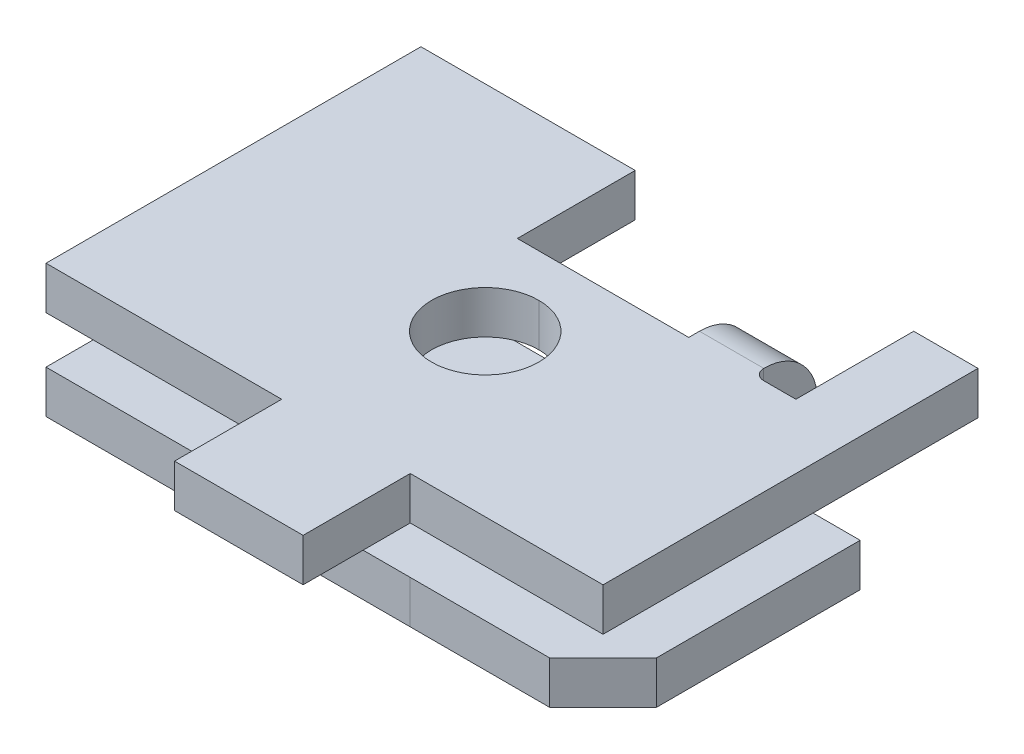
ISO-10303-21;
HEADER;
FILE_DESCRIPTION(('STEP AP214'),'2;1');
FILE_NAME('part.step','',(''),(''),'','','');
FILE_SCHEMA(('AUTOMOTIVE_DESIGN { 1 0 10303 214 1 1 1 1 }'));
ENDSEC;
DATA;
#1=APPLICATION_CONTEXT('core data for automotive mechanical design processes');
#2=APPLICATION_PROTOCOL_DEFINITION('international standard','automotive_design',2000,#1);
#3=PRODUCT_CONTEXT('',#1,'mechanical');
#4=PRODUCT('Part','Part','',(#3));
#5=PRODUCT_RELATED_PRODUCT_CATEGORY('part','',(#4));
#6=PRODUCT_DEFINITION_FORMATION('','',#4);
#7=PRODUCT_DEFINITION_CONTEXT('part definition',#1,'design');
#8=PRODUCT_DEFINITION('design','',#6,#7);
#9=PRODUCT_DEFINITION_SHAPE('','',#8);
#10=(LENGTH_UNIT() NAMED_UNIT(*) SI_UNIT(.MILLI.,.METRE.));
#11=(NAMED_UNIT(*) PLANE_ANGLE_UNIT() SI_UNIT($,.RADIAN.));
#12=(NAMED_UNIT(*) SI_UNIT($,.STERADIAN.) SOLID_ANGLE_UNIT());
#13=UNCERTAINTY_MEASURE_WITH_UNIT(LENGTH_MEASURE(1.E-05),#10,'distance_accuracy_value','');
#14=(GEOMETRIC_REPRESENTATION_CONTEXT(3) GLOBAL_UNCERTAINTY_ASSIGNED_CONTEXT((#13)) GLOBAL_UNIT_ASSIGNED_CONTEXT((#10,
#11,#12)) REPRESENTATION_CONTEXT('',''));
#15=CARTESIAN_POINT('',(0.,0.,0.));
#16=DIRECTION('',(0.,0.,1.));
#17=DIRECTION('',(1.,0.,0.));
#18=AXIS2_PLACEMENT_3D('',#15,#16,#17);
#19=CARTESIAN_POINT('',(7.89110178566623,6.01717338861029,12.2699844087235));
#20=DIRECTION('',(-1.,0.,0.));
#21=DIRECTION('',(0.,1.,0.));
#22=AXIS2_PLACEMENT_3D('',#19,#20,#21);
#23=PLANE('',#22);
#24=DIRECTION('',(0.,1.,0.));
#25=VECTOR('',#24,1.);
#26=CARTESIAN_POINT('',(7.89110178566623,5.51717338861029,12.7699844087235));
#27=LINE('',#26,#25);
#28=CARTESIAN_POINT('',(7.89110178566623,3.5171733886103,12.7699844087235));
#29=VERTEX_POINT('',#28);
#30=CARTESIAN_POINT('',(7.89110178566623,5.51717338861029,12.7699844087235));
#31=VERTEX_POINT('',#30);
#32=EDGE_CURVE('E481',#29,#31,#27,.T.);
#33=ORIENTED_EDGE('',*,*,#32,.T.);
#34=DIRECTION('',(0.,0.,-1.));
#35=VECTOR('',#34,1.);
#36=CARTESIAN_POINT('',(7.89110178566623,5.51717338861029,12.2699844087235));
#37=LINE('',#36,#35);
#38=CARTESIAN_POINT('',(7.89110178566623,5.51717338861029,12.2699844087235));
#39=VERTEX_POINT('',#38);
#40=EDGE_CURVE('E377',#31,#39,#37,.T.);
#41=ORIENTED_EDGE('',*,*,#40,.T.);
#42=CARTESIAN_POINT('',(7.89110178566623,6.01717338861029,12.2699844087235));
#43=DIRECTION('',(1.,0.,0.));
#44=DIRECTION('',(0.,1.,0.));
#45=AXIS2_PLACEMENT_3D('',#42,#43,#44);
#46=CIRCLE('',#45,0.5);
#47=CARTESIAN_POINT('',(7.89110178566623,6.01717338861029,11.7699844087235));
#48=VERTEX_POINT('',#47);
#49=EDGE_CURVE('E359',#39,#48,#46,.T.);
#50=ORIENTED_EDGE('',*,*,#49,.T.);
#51=DIRECTION('',(0.,1.,0.));
#52=VECTOR('',#51,1.);
#53=CARTESIAN_POINT('',(7.89110178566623,6.01717338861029,11.7699844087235));
#54=LINE('',#53,#52);
#55=CARTESIAN_POINT('',(7.89110178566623,7.21717338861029,11.7699844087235));
#56=VERTEX_POINT('',#55);
#57=EDGE_CURVE('E487',#48,#56,#54,.T.);
#58=ORIENTED_EDGE('',*,*,#57,.T.);
#59=CARTESIAN_POINT('',(7.89110178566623,7.21717338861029,12.2699844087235));
#60=DIRECTION('',(1.,0.,0.));
#61=DIRECTION('',(0.,1.,0.));
#62=AXIS2_PLACEMENT_3D('',#59,#60,#61);
#63=CIRCLE('',#62,0.5);
#64=CARTESIAN_POINT('',(7.89110178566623,7.71717338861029,12.2699844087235));
#65=VERTEX_POINT('',#64);
#66=EDGE_CURVE('E406',#56,#65,#63,.T.);
#67=ORIENTED_EDGE('',*,*,#66,.T.);
#68=DIRECTION('',(0.,0.,1.));
#69=VECTOR('',#68,1.);
#70=CARTESIAN_POINT('',(7.89110178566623,7.71717338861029,12.2699844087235));
#71=LINE('',#70,#69);
#72=CARTESIAN_POINT('',(7.89110178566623,7.71717338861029,12.7699844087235));
#73=VERTEX_POINT('',#72);
#74=EDGE_CURVE('E1154',#65,#73,#71,.T.);
#75=ORIENTED_EDGE('',*,*,#74,.T.);
#76=DIRECTION('',(0.,1.,0.));
#77=VECTOR('',#76,1.);
#78=CARTESIAN_POINT('',(7.89110178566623,9.71717338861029,12.7699844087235));
#79=LINE('',#78,#77);
#80=CARTESIAN_POINT('',(7.89110178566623,9.71717338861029,12.7699844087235));
#81=VERTEX_POINT('',#80);
#82=EDGE_CURVE('E478',#73,#81,#79,.T.);
#83=ORIENTED_EDGE('',*,*,#82,.T.);
#84=DIRECTION('',(0.,0.,-1.));
#85=VECTOR('',#84,1.);
#86=CARTESIAN_POINT('',(7.89110178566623,9.71717338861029,12.2699844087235));
#87=LINE('',#86,#85);
#88=CARTESIAN_POINT('',(7.89110178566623,9.71717338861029,12.2699844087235));
#89=VERTEX_POINT('',#88);
#90=EDGE_CURVE('E1040',#81,#89,#87,.T.);
#91=ORIENTED_EDGE('',*,*,#90,.T.);
#92=CARTESIAN_POINT('',(7.89110178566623,7.21717338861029,12.2699844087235));
#93=DIRECTION('',(-1.,0.,0.));
#94=DIRECTION('',(0.,1.,0.));
#95=AXIS2_PLACEMENT_3D('',#92,#93,#94);
#96=CIRCLE('',#95,2.5);
#97=CARTESIAN_POINT('',(7.89110178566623,7.21717338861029,9.76998440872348));
#98=VERTEX_POINT('',#97);
#99=EDGE_CURVE('E423',#89,#98,#96,.T.);
#100=ORIENTED_EDGE('',*,*,#99,.T.);
#101=DIRECTION('',(0.,-1.,0.));
#102=VECTOR('',#101,1.);
#103=CARTESIAN_POINT('',(7.89110178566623,6.01717338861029,9.76998440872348));
#104=LINE('',#103,#102);
#105=CARTESIAN_POINT('',(7.89110178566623,6.01717338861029,9.76998440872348));
#106=VERTEX_POINT('',#105);
#107=EDGE_CURVE('E33',#98,#106,#104,.T.);
#108=ORIENTED_EDGE('',*,*,#107,.T.);
#109=CARTESIAN_POINT('',(7.89110178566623,6.01717338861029,12.2699844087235));
#110=DIRECTION('',(-1.,0.,0.));
#111=DIRECTION('',(0.,1.,0.));
#112=AXIS2_PLACEMENT_3D('',#109,#110,#111);
#113=CIRCLE('',#112,2.5);
#114=CARTESIAN_POINT('',(7.89110178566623,3.5171733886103,12.2699844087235));
#115=VERTEX_POINT('',#114);
#116=EDGE_CURVE('E433',#106,#115,#113,.T.);
#117=ORIENTED_EDGE('',*,*,#116,.T.);
#118=DIRECTION('',(0.,0.,1.));
#119=VECTOR('',#118,1.);
#120=CARTESIAN_POINT('',(7.89110178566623,3.5171733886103,12.2699844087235));
#121=LINE('',#120,#119);
#122=EDGE_CURVE('E383',#115,#29,#121,.T.);
#123=ORIENTED_EDGE('',*,*,#122,.T.);
#124=EDGE_LOOP('',(#33,#41,#50,#58,#67,#75,#83,#91,#100,#108,#117,#123));
#125=FACE_BOUND('',#124,.T.);
#126=ADVANCED_FACE('F15',(#125),#23,.T.);
#127=CARTESIAN_POINT('',(-10.1088982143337,9.7171733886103,24.7699844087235));
#128=DIRECTION('',(0.,0.,1.));
#129=DIRECTION('',(0.,-1.,0.));
#130=AXIS2_PLACEMENT_3D('',#127,#128,#129);
#131=PLANE('',#130);
#132=DIRECTION('',(1.,0.,0.));
#133=VECTOR('',#132,1.);
#134=CARTESIAN_POINT('',(17.8911017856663,7.7171733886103,24.7699844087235));
#135=LINE('',#134,#133);
#136=CARTESIAN_POINT('',(-10.1088982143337,7.7171733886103,24.7699844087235));
#137=VERTEX_POINT('',#136);
#138=CARTESIAN_POINT('',(0.891101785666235,7.7171733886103,24.7699844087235));
#139=VERTEX_POINT('',#138);
#140=EDGE_CURVE('E1002',#137,#139,#135,.T.);
#141=ORIENTED_EDGE('',*,*,#140,.T.);
#142=DIRECTION('',(0.,-1.,0.));
#143=VECTOR('',#142,1.);
#144=CARTESIAN_POINT('',(0.891101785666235,9.7171733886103,24.7699844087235));
#145=LINE('',#144,#143);
#146=CARTESIAN_POINT('',(0.891101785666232,9.71717338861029,24.7699844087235));
#147=VERTEX_POINT('',#146);
#148=EDGE_CURVE('E10',#147,#139,#145,.T.);
#149=ORIENTED_EDGE('',*,*,#148,.F.);
#150=DIRECTION('',(-1.,0.,0.));
#151=VECTOR('',#150,1.);
#152=CARTESIAN_POINT('',(-10.1088982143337,9.7171733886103,24.7699844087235));
#153=LINE('',#152,#151);
#154=CARTESIAN_POINT('',(-10.1088982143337,9.7171733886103,24.7699844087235));
#155=VERTEX_POINT('',#154);
#156=EDGE_CURVE('E1080',#147,#155,#153,.T.);
#157=ORIENTED_EDGE('',*,*,#156,.T.);
#158=DIRECTION('',(0.,-1.,0.));
#159=VECTOR('',#158,1.);
#160=CARTESIAN_POINT('',(-10.1088982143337,9.7171733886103,24.7699844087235));
#161=LINE('',#160,#159);
#162=EDGE_CURVE('E407',#155,#137,#161,.T.);
#163=ORIENTED_EDGE('',*,*,#162,.T.);
#164=EDGE_LOOP('',(#141,#149,#157,#163));
#165=FACE_BOUND('',#164,.T.);
#166=ADVANCED_FACE('F836',(#165),#131,.T.);
#167=CARTESIAN_POINT('',(0.891101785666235,9.7171733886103,24.7699844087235));
#168=DIRECTION('',(-1.,0.,0.));
#169=DIRECTION('',(0.,1.,0.));
#170=AXIS2_PLACEMENT_3D('',#167,#168,#169);
#171=PLANE('',#170);
#172=DIRECTION('',(0.,0.,1.));
#173=VECTOR('',#172,1.);
#174=CARTESIAN_POINT('',(0.891101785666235,7.7171733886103,26.2699844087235));
#175=LINE('',#174,#173);
#176=CARTESIAN_POINT('',(0.891101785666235,7.7171733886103,29.7699844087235));
#177=VERTEX_POINT('',#176);
#178=EDGE_CURVE('E991',#139,#177,#175,.T.);
#179=ORIENTED_EDGE('',*,*,#178,.T.);
#180=DIRECTION('',(0.,-1.,0.));
#181=VECTOR('',#180,1.);
#182=CARTESIAN_POINT('',(0.891101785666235,9.71717338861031,29.7699844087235));
#183=LINE('',#182,#181);
#184=CARTESIAN_POINT('',(0.891101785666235,9.71717338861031,29.7699844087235));
#185=VERTEX_POINT('',#184);
#186=EDGE_CURVE('E399',#185,#177,#183,.T.);
#187=ORIENTED_EDGE('',*,*,#186,.F.);
#188=DIRECTION('',(0.,0.,-1.));
#189=VECTOR('',#188,1.);
#190=CARTESIAN_POINT('',(0.891101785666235,9.7171733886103,24.7699844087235));
#191=LINE('',#190,#189);
#192=EDGE_CURVE('E342',#185,#147,#191,.T.);
#193=ORIENTED_EDGE('',*,*,#192,.T.);
#194=ORIENTED_EDGE('',*,*,#148,.T.);
#195=EDGE_LOOP('',(#179,#187,#193,#194));
#196=FACE_BOUND('',#195,.T.);
#197=ADVANCED_FACE('F828',(#196),#171,.T.);
#198=CARTESIAN_POINT('',(6.89110178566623,9.7171733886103,24.7699844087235));
#199=DIRECTION('',(0.,0.,1.));
#200=DIRECTION('',(0.,-1.,0.));
#201=AXIS2_PLACEMENT_3D('',#198,#199,#200);
#202=PLANE('',#201);
#203=DIRECTION('',(1.,0.,0.));
#204=VECTOR('',#203,1.);
#205=CARTESIAN_POINT('',(17.8911017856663,7.7171733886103,24.7699844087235));
#206=LINE('',#205,#204);
#207=CARTESIAN_POINT('',(6.89110178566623,7.7171733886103,24.7699844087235));
#208=VERTEX_POINT('',#207);
#209=CARTESIAN_POINT('',(15.8911017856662,7.7171733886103,24.7699844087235));
#210=VERTEX_POINT('',#209);
#211=EDGE_CURVE('E983',#208,#210,#206,.T.);
#212=ORIENTED_EDGE('',*,*,#211,.T.);
#213=DIRECTION('',(0.,1.,0.));
#214=VECTOR('',#213,1.);
#215=CARTESIAN_POINT('',(15.8911017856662,7.7171733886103,24.7699844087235));
#216=LINE('',#215,#214);
#217=CARTESIAN_POINT('',(15.8911017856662,9.7171733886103,24.7699844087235));
#218=VERTEX_POINT('',#217);
#219=EDGE_CURVE('E326',#210,#218,#216,.T.);
#220=ORIENTED_EDGE('',*,*,#219,.T.);
#221=DIRECTION('',(-1.,0.,0.));
#222=VECTOR('',#221,1.);
#223=CARTESIAN_POINT('',(6.89110178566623,9.7171733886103,24.7699844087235));
#224=LINE('',#223,#222);
#225=CARTESIAN_POINT('',(6.89110178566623,9.7171733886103,24.7699844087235));
#226=VERTEX_POINT('',#225);
#227=EDGE_CURVE('E324',#218,#226,#224,.T.);
#228=ORIENTED_EDGE('',*,*,#227,.T.);
#229=DIRECTION('',(0.,-1.,0.));
#230=VECTOR('',#229,1.);
#231=CARTESIAN_POINT('',(6.89110178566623,9.7171733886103,24.7699844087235));
#232=LINE('',#231,#230);
#233=EDGE_CURVE('E23',#226,#208,#232,.T.);
#234=ORIENTED_EDGE('',*,*,#233,.T.);
#235=EDGE_LOOP('',(#212,#220,#228,#234));
#236=FACE_BOUND('',#235,.T.);
#237=ADVANCED_FACE('F325',(#236),#202,.T.);
#238=CARTESIAN_POINT('',(6.89110178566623,9.7171733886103,29.7699844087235));
#239=DIRECTION('',(1.,0.,0.));
#240=DIRECTION('',(0.,1.,0.));
#241=AXIS2_PLACEMENT_3D('',#238,#239,#240);
#242=PLANE('',#241);
#243=DIRECTION('',(0.,0.,-1.));
#244=VECTOR('',#243,1.);
#245=CARTESIAN_POINT('',(6.89110178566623,7.7171733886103,26.2699844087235));
#246=LINE('',#245,#244);
#247=CARTESIAN_POINT('',(6.89110178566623,7.7171733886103,29.7699844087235));
#248=VERTEX_POINT('',#247);
#249=EDGE_CURVE('E317',#248,#208,#246,.T.);
#250=ORIENTED_EDGE('',*,*,#249,.T.);
#251=ORIENTED_EDGE('',*,*,#233,.F.);
#252=DIRECTION('',(0.,0.,1.));
#253=VECTOR('',#252,1.);
#254=CARTESIAN_POINT('',(6.89110178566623,9.7171733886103,29.7699844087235));
#255=LINE('',#254,#253);
#256=CARTESIAN_POINT('',(6.89110178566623,9.7171733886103,29.7699844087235));
#257=VERTEX_POINT('',#256);
#258=EDGE_CURVE('E314',#226,#257,#255,.T.);
#259=ORIENTED_EDGE('',*,*,#258,.T.);
#260=DIRECTION('',(0.,-1.,0.));
#261=VECTOR('',#260,1.);
#262=CARTESIAN_POINT('',(6.89110178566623,9.7171733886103,29.7699844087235));
#263=LINE('',#262,#261);
#264=EDGE_CURVE('E402',#257,#248,#263,.T.);
#265=ORIENTED_EDGE('',*,*,#264,.T.);
#266=EDGE_LOOP('',(#250,#251,#259,#265));
#267=FACE_BOUND('',#266,.T.);
#268=ADVANCED_FACE('F312',(#267),#242,.T.);
#269=CARTESIAN_POINT('',(17.8911017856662,6.01717338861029,9.76998440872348));
#270=DIRECTION('',(0.,0.,-1.));
#271=DIRECTION('',(1.,0.,0.));
#272=AXIS2_PLACEMENT_3D('',#269,#270,#271);
#273=PLANE('',#272);
#274=DIRECTION('',(-1.,0.,0.));
#275=VECTOR('',#274,1.);
#276=CARTESIAN_POINT('',(17.8911017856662,7.21717338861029,9.76998440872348));
#277=LINE('',#276,#275);
#278=CARTESIAN_POINT('',(10.8911017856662,7.21717338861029,9.76998440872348));
#279=VERTEX_POINT('',#278);
#280=EDGE_CURVE('E427',#279,#98,#277,.T.);
#281=ORIENTED_EDGE('',*,*,#280,.F.);
#282=DIRECTION('',(0.,-1.,0.));
#283=VECTOR('',#282,1.);
#284=CARTESIAN_POINT('',(10.8911017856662,6.01717338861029,9.76998440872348));
#285=LINE('',#284,#283);
#286=CARTESIAN_POINT('',(10.8911017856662,6.01717338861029,9.76998440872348));
#287=VERTEX_POINT('',#286);
#288=EDGE_CURVE('E443',#279,#287,#285,.T.);
#289=ORIENTED_EDGE('',*,*,#288,.T.);
#290=DIRECTION('',(-1.,0.,0.));
#291=VECTOR('',#290,1.);
#292=CARTESIAN_POINT('',(17.8911017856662,6.01717338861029,9.76998440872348));
#293=LINE('',#292,#291);
#294=EDGE_CURVE('E426',#287,#106,#293,.T.);
#295=ORIENTED_EDGE('',*,*,#294,.T.);
#296=ORIENTED_EDGE('',*,*,#107,.F.);
#297=EDGE_LOOP('',(#281,#289,#295,#296));
#298=FACE_BOUND('',#297,.T.);
#299=ADVANCED_FACE('F571',(#298),#273,.T.);
#300=CARTESIAN_POINT('',(17.8911017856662,6.01717338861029,12.2699844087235));
#301=DIRECTION('',(-1.,0.,0.));
#302=DIRECTION('',(0.,0.,1.));
#303=AXIS2_PLACEMENT_3D('',#300,#301,#302);
#304=CYLINDRICAL_SURFACE('',#303,2.5);
#305=ORIENTED_EDGE('',*,*,#294,.F.);
#306=CARTESIAN_POINT('',(10.8911017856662,6.01717338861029,12.2699844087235));
#307=DIRECTION('',(-1.,0.,0.));
#308=DIRECTION('',(0.,0.,1.));
#309=AXIS2_PLACEMENT_3D('',#306,#307,#308);
#310=CIRCLE('',#309,2.5);
#311=CARTESIAN_POINT('',(10.8911017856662,3.51717338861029,12.2699844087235));
#312=VERTEX_POINT('',#311);
#313=EDGE_CURVE('E378',#287,#312,#310,.T.);
#314=ORIENTED_EDGE('',*,*,#313,.T.);
#315=DIRECTION('',(-1.,0.,0.));
#316=VECTOR('',#315,1.);
#317=CARTESIAN_POINT('',(17.8911017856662,3.51717338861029,12.2699844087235));
#318=LINE('',#317,#316);
#319=EDGE_CURVE('E387',#312,#115,#318,.T.);
#320=ORIENTED_EDGE('',*,*,#319,.T.);
#321=ORIENTED_EDGE('',*,*,#116,.F.);
#322=EDGE_LOOP('',(#305,#314,#320,#321));
#323=FACE_BOUND('',#322,.T.);
#324=ADVANCED_FACE('F566',(#323),#304,.T.);
#325=CARTESIAN_POINT('',(17.8911017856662,7.21717338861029,12.2699844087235));
#326=DIRECTION('',(-1.,0.,0.));
#327=DIRECTION('',(0.,0.,1.));
#328=AXIS2_PLACEMENT_3D('',#325,#326,#327);
#329=CYLINDRICAL_SURFACE('',#328,2.5);
#330=DIRECTION('',(-1.,0.,0.));
#331=VECTOR('',#330,1.);
#332=CARTESIAN_POINT('',(17.8911017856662,9.71717338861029,12.2699844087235));
#333=LINE('',#332,#331);
#334=CARTESIAN_POINT('',(10.8911017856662,9.7171733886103,12.2699844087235));
#335=VERTEX_POINT('',#334);
#336=EDGE_CURVE('E1035',#335,#89,#333,.T.);
#337=ORIENTED_EDGE('',*,*,#336,.F.);
#338=CARTESIAN_POINT('',(10.8911017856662,7.21717338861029,12.2699844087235));
#339=DIRECTION('',(-1.,0.,0.));
#340=DIRECTION('',(0.,0.,1.));
#341=AXIS2_PLACEMENT_3D('',#338,#339,#340);
#342=CIRCLE('',#341,2.5);
#343=EDGE_CURVE('E455',#335,#279,#342,.T.);
#344=ORIENTED_EDGE('',*,*,#343,.T.);
#345=ORIENTED_EDGE('',*,*,#280,.T.);
#346=ORIENTED_EDGE('',*,*,#99,.F.);
#347=EDGE_LOOP('',(#337,#344,#345,#346));
#348=FACE_BOUND('',#347,.T.);
#349=ADVANCED_FACE('F570',(#348),#329,.T.);
#350=CARTESIAN_POINT('',(17.8911017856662,6.01717338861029,11.7699844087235));
#351=DIRECTION('',(0.,0.,-1.));
#352=DIRECTION('',(1.,0.,0.));
#353=AXIS2_PLACEMENT_3D('',#350,#351,#352);
#354=PLANE('',#353);
#355=DIRECTION('',(-1.,0.,0.));
#356=VECTOR('',#355,1.);
#357=CARTESIAN_POINT('',(17.8911017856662,7.21717338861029,11.7699844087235));
#358=LINE('',#357,#356);
#359=CARTESIAN_POINT('',(10.8911017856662,7.21717338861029,11.7699844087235));
#360=VERTEX_POINT('',#359);
#361=EDGE_CURVE('E360',#360,#56,#358,.T.);
#362=ORIENTED_EDGE('',*,*,#361,.T.);
#363=ORIENTED_EDGE('',*,*,#57,.F.);
#364=DIRECTION('',(-1.,0.,0.));
#365=VECTOR('',#364,1.);
#366=CARTESIAN_POINT('',(17.8911017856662,6.01717338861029,11.7699844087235));
#367=LINE('',#366,#365);
#368=CARTESIAN_POINT('',(10.8911017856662,6.01717338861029,11.7699844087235));
#369=VERTEX_POINT('',#368);
#370=EDGE_CURVE('E355',#369,#48,#367,.T.);
#371=ORIENTED_EDGE('',*,*,#370,.F.);
#372=DIRECTION('',(0.,-1.,0.));
#373=VECTOR('',#372,1.);
#374=CARTESIAN_POINT('',(10.8911017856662,1.71717338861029,11.7699844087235));
#375=LINE('',#374,#373);
#376=EDGE_CURVE('E451',#360,#369,#375,.T.);
#377=ORIENTED_EDGE('',*,*,#376,.F.);
#378=EDGE_LOOP('',(#362,#363,#371,#377));
#379=FACE_BOUND('',#378,.T.);
#380=ADVANCED_FACE('F791',(#379),#354,.F.);
#381=CARTESIAN_POINT('',(17.8911017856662,6.01717338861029,12.2699844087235));
#382=DIRECTION('',(-1.,0.,0.));
#383=DIRECTION('',(0.,0.,1.));
#384=AXIS2_PLACEMENT_3D('',#381,#382,#383);
#385=CYLINDRICAL_SURFACE('',#384,0.5);
#386=ORIENTED_EDGE('',*,*,#370,.T.);
#387=ORIENTED_EDGE('',*,*,#49,.F.);
#388=DIRECTION('',(-1.,0.,0.));
#389=VECTOR('',#388,1.);
#390=CARTESIAN_POINT('',(17.8911017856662,5.51717338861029,12.2699844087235));
#391=LINE('',#390,#389);
#392=CARTESIAN_POINT('',(10.8911017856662,5.51717338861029,12.2699844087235));
#393=VERTEX_POINT('',#392);
#394=EDGE_CURVE('E373',#393,#39,#391,.T.);
#395=ORIENTED_EDGE('',*,*,#394,.F.);
#396=CARTESIAN_POINT('',(10.8911017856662,6.01717338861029,12.2699844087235));
#397=DIRECTION('',(-1.,0.,0.));
#398=DIRECTION('',(0.,0.,1.));
#399=AXIS2_PLACEMENT_3D('',#396,#397,#398);
#400=CIRCLE('',#399,0.5);
#401=EDGE_CURVE('E442',#369,#393,#400,.T.);
#402=ORIENTED_EDGE('',*,*,#401,.F.);
#403=EDGE_LOOP('',(#386,#387,#395,#402));
#404=FACE_BOUND('',#403,.T.);
#405=ADVANCED_FACE('F782',(#404),#385,.F.);
#406=CARTESIAN_POINT('',(17.8911017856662,7.21717338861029,12.2699844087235));
#407=DIRECTION('',(-1.,0.,0.));
#408=DIRECTION('',(0.,0.,1.));
#409=AXIS2_PLACEMENT_3D('',#406,#407,#408);
#410=CYLINDRICAL_SURFACE('',#409,0.5);
#411=DIRECTION('',(-1.,0.,0.));
#412=VECTOR('',#411,1.);
#413=CARTESIAN_POINT('',(17.8911017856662,7.71717338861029,12.2699844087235));
#414=LINE('',#413,#412);
#415=CARTESIAN_POINT('',(10.8911017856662,7.71717338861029,12.2699844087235));
#416=VERTEX_POINT('',#415);
#417=EDGE_CURVE('E1157',#416,#65,#414,.T.);
#418=ORIENTED_EDGE('',*,*,#417,.T.);
#419=ORIENTED_EDGE('',*,*,#66,.F.);
#420=ORIENTED_EDGE('',*,*,#361,.F.);
#421=CARTESIAN_POINT('',(10.8911017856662,7.21717338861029,12.2699844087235));
#422=DIRECTION('',(-1.,0.,0.));
#423=DIRECTION('',(0.,0.,1.));
#424=AXIS2_PLACEMENT_3D('',#421,#422,#423);
#425=CIRCLE('',#424,0.5);
#426=EDGE_CURVE('E460',#416,#360,#425,.T.);
#427=ORIENTED_EDGE('',*,*,#426,.F.);
#428=EDGE_LOOP('',(#418,#419,#420,#427));
#429=FACE_BOUND('',#428,.T.);
#430=ADVANCED_FACE('F773',(#429),#410,.F.);
#431=CARTESIAN_POINT('',(2.89110178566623,7.71717338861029,17.2699844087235));
#432=DIRECTION('',(0.,1.,0.));
#433=DIRECTION('',(0.,0.,1.));
#434=AXIS2_PLACEMENT_3D('',#431,#432,#433);
#435=CYLINDRICAL_SURFACE('',#434,2.5);
#436=DIRECTION('',(0.,1.,0.));
#437=VECTOR('',#436,1.);
#438=CARTESIAN_POINT('',(2.89110178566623,7.71717338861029,14.7699844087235));
#439=LINE('',#438,#437);
#440=CARTESIAN_POINT('',(2.89110178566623,7.71717338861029,14.7699844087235));
#441=VERTEX_POINT('',#440);
#442=CARTESIAN_POINT('',(2.89110178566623,9.71717338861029,14.7699844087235));
#443=VERTEX_POINT('',#442);
#444=EDGE_CURVE('E1103',#441,#443,#439,.T.);
#445=ORIENTED_EDGE('',*,*,#444,.F.);
#446=CARTESIAN_POINT('',(2.89110178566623,7.71717338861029,17.2699844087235));
#447=DIRECTION('',(0.,-1.,0.));
#448=DIRECTION('',(0.,0.,1.));
#449=AXIS2_PLACEMENT_3D('',#446,#447,#448);
#450=CIRCLE('',#449,2.5);
#451=CARTESIAN_POINT('',(2.89110178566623,7.71717338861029,19.7699844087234));
#452=VERTEX_POINT('',#451);
#453=EDGE_CURVE('E1032',#441,#452,#450,.T.);
#454=ORIENTED_EDGE('',*,*,#453,.T.);
#455=DIRECTION('',(0.,1.,0.));
#456=VECTOR('',#455,1.);
#457=CARTESIAN_POINT('',(2.89110178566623,7.71717338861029,19.7699844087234));
#458=LINE('',#457,#456);
#459=CARTESIAN_POINT('',(2.89110178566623,9.7171733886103,19.7699844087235));
#460=VERTEX_POINT('',#459);
#461=EDGE_CURVE('E1111',#452,#460,#458,.T.);
#462=ORIENTED_EDGE('',*,*,#461,.T.);
#463=CARTESIAN_POINT('',(2.89110178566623,9.71717338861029,17.2699844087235));
#464=DIRECTION('',(0.,-1.,0.));
#465=DIRECTION('',(0.,0.,1.));
#466=AXIS2_PLACEMENT_3D('',#463,#464,#465);
#467=CIRCLE('',#466,2.5);
#468=EDGE_CURVE('E370',#443,#460,#467,.T.);
#469=ORIENTED_EDGE('',*,*,#468,.F.);
#470=EDGE_LOOP('',(#445,#454,#462,#469));
#471=FACE_BOUND('',#470,.T.);
#472=ADVANCED_FACE('F622',(#471),#435,.F.);
#473=CARTESIAN_POINT('',(2.89110178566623,5.51717338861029,17.2699844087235));
#474=DIRECTION('',(0.,-1.,0.));
#475=DIRECTION('',(0.,0.,-1.));
#476=AXIS2_PLACEMENT_3D('',#473,#474,#475);
#477=CYLINDRICAL_SURFACE('',#476,1.65);
#478=DIRECTION('',(0.,-1.,0.));
#479=VECTOR('',#478,1.);
#480=CARTESIAN_POINT('',(2.89110178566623,5.51717338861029,18.9199844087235));
#481=LINE('',#480,#479);
#482=CARTESIAN_POINT('',(2.89110178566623,5.51717338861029,18.9199844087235));
#483=VERTEX_POINT('',#482);
#484=CARTESIAN_POINT('',(2.89110178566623,3.5171733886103,18.9199844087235));
#485=VERTEX_POINT('',#484);
#486=EDGE_CURVE('E1136',#483,#485,#481,.T.);
#487=ORIENTED_EDGE('',*,*,#486,.F.);
#488=CARTESIAN_POINT('',(2.89110178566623,5.51717338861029,17.2699844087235));
#489=DIRECTION('',(0.,1.,0.));
#490=DIRECTION('',(0.,0.,-1.));
#491=AXIS2_PLACEMENT_3D('',#488,#489,#490);
#492=CIRCLE('',#491,1.65);
#493=CARTESIAN_POINT('',(2.89110178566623,5.51717338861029,15.6199844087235));
#494=VERTEX_POINT('',#493);
#495=EDGE_CURVE('E388',#483,#494,#492,.T.);
#496=ORIENTED_EDGE('',*,*,#495,.T.);
#497=DIRECTION('',(0.,-1.,0.));
#498=VECTOR('',#497,1.);
#499=CARTESIAN_POINT('',(2.89110178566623,5.51717338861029,15.6199844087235));
#500=LINE('',#499,#498);
#501=CARTESIAN_POINT('',(2.89110178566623,3.5171733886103,15.6199844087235));
#502=VERTEX_POINT('',#501);
#503=EDGE_CURVE('E1147',#494,#502,#500,.T.);
#504=ORIENTED_EDGE('',*,*,#503,.T.);
#505=CARTESIAN_POINT('',(2.89110178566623,3.5171733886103,17.2699844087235));
#506=DIRECTION('',(0.,1.,0.));
#507=DIRECTION('',(0.,0.,-1.));
#508=AXIS2_PLACEMENT_3D('',#505,#506,#507);
#509=CIRCLE('',#508,1.65);
#510=EDGE_CURVE('E345',#485,#502,#509,.T.);
#511=ORIENTED_EDGE('',*,*,#510,.F.);
#512=EDGE_LOOP('',(#487,#496,#504,#511));
#513=FACE_BOUND('',#512,.T.);
#514=ADVANCED_FACE('F617',(#513),#477,.F.);
#515=CARTESIAN_POINT('',(5.89110178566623,5.51717338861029,12.7699844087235));
#516=DIRECTION('',(0.,0.,-1.));
#517=DIRECTION('',(0.,-1.,0.));
#518=AXIS2_PLACEMENT_3D('',#515,#516,#517);
#519=PLANE('',#518);
#520=ORIENTED_EDGE('',*,*,#32,.F.);
#521=DIRECTION('',(1.,0.,0.));
#522=VECTOR('',#521,1.);
#523=CARTESIAN_POINT('',(17.8911017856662,3.51717338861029,12.7699844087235));
#524=LINE('',#523,#522);
#525=CARTESIAN_POINT('',(-10.1088982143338,3.5171733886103,12.7699844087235));
#526=VERTEX_POINT('',#525);
#527=EDGE_CURVE('E1088',#526,#29,#524,.T.);
#528=ORIENTED_EDGE('',*,*,#527,.F.);
#529=DIRECTION('',(0.,1.,0.));
#530=VECTOR('',#529,1.);
#531=CARTESIAN_POINT('',(-10.1088982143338,5.51717338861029,12.7699844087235));
#532=LINE('',#531,#530);
#533=CARTESIAN_POINT('',(-10.1088982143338,5.51717338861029,12.7699844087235));
#534=VERTEX_POINT('',#533);
#535=EDGE_CURVE('E413',#526,#534,#532,.T.);
#536=ORIENTED_EDGE('',*,*,#535,.T.);
#537=DIRECTION('',(1.,0.,0.));
#538=VECTOR('',#537,1.);
#539=CARTESIAN_POINT('',(5.89110178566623,5.51717338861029,12.7699844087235));
#540=LINE('',#539,#538);
#541=EDGE_CURVE('E951',#534,#31,#540,.T.);
#542=ORIENTED_EDGE('',*,*,#541,.T.);
#543=EDGE_LOOP('',(#520,#528,#536,#542));
#544=FACE_BOUND('',#543,.T.);
#545=ADVANCED_FACE('F621',(#544),#519,.T.);
#546=CARTESIAN_POINT('',(5.89110178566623,7.71717338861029,12.7699844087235));
#547=DIRECTION('',(0.,0.,-1.));
#548=DIRECTION('',(0.,-1.,0.));
#549=AXIS2_PLACEMENT_3D('',#546,#547,#548);
#550=PLANE('',#549);
#551=ORIENTED_EDGE('',*,*,#82,.F.);
#552=DIRECTION('',(-1.,0.,0.));
#553=VECTOR('',#552,1.);
#554=CARTESIAN_POINT('',(-12.1088982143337,7.71717338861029,12.7699844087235));
#555=LINE('',#554,#553);
#556=CARTESIAN_POINT('',(-0.10889821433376,7.71717338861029,12.7699844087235));
#557=VERTEX_POINT('',#556);
#558=EDGE_CURVE('E1031',#73,#557,#555,.T.);
#559=ORIENTED_EDGE('',*,*,#558,.T.);
#560=DIRECTION('',(0.,-1.,0.));
#561=VECTOR('',#560,1.);
#562=CARTESIAN_POINT('',(-0.10889821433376,7.71717338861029,12.7699844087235));
#563=LINE('',#562,#561);
#564=CARTESIAN_POINT('',(-0.10889821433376,9.71717338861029,12.7699844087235));
#565=VERTEX_POINT('',#564);
#566=EDGE_CURVE('E475',#565,#557,#563,.T.);
#567=ORIENTED_EDGE('',*,*,#566,.F.);
#568=DIRECTION('',(-1.,0.,0.));
#569=VECTOR('',#568,1.);
#570=CARTESIAN_POINT('',(17.8911017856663,9.7171733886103,12.7699844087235));
#571=LINE('',#570,#569);
#572=EDGE_CURVE('E1048',#81,#565,#571,.T.);
#573=ORIENTED_EDGE('',*,*,#572,.F.);
#574=EDGE_LOOP('',(#551,#559,#567,#573));
#575=FACE_BOUND('',#574,.T.);
#576=ADVANCED_FACE('F750',(#575),#550,.T.);
#577=CARTESIAN_POINT('',(-0.10889821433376,7.71717338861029,12.7699844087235));
#578=DIRECTION('',(-1.,0.,0.));
#579=DIRECTION('',(0.,0.,-1.));
#580=AXIS2_PLACEMENT_3D('',#577,#578,#579);
#581=PLANE('',#580);
#582=DIRECTION('',(0.,-1.,0.));
#583=VECTOR('',#582,1.);
#584=CARTESIAN_POINT('',(-0.10889821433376,7.71717338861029,7.26998440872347));
#585=LINE('',#584,#583);
#586=CARTESIAN_POINT('',(-0.10889821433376,9.71717338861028,7.26998440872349));
#587=VERTEX_POINT('',#586);
#588=CARTESIAN_POINT('',(-0.10889821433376,7.71717338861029,7.26998440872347));
#589=VERTEX_POINT('',#588);
#590=EDGE_CURVE('E472',#587,#589,#585,.T.);
#591=ORIENTED_EDGE('',*,*,#590,.F.);
#592=DIRECTION('',(0.,0.,1.));
#593=VECTOR('',#592,1.);
#594=CARTESIAN_POINT('',(-0.10889821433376,9.7171733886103,26.2699844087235));
#595=LINE('',#594,#593);
#596=EDGE_CURVE('E1056',#587,#565,#595,.T.);
#597=ORIENTED_EDGE('',*,*,#596,.T.);
#598=ORIENTED_EDGE('',*,*,#566,.T.);
#599=DIRECTION('',(0.,0.,1.));
#600=VECTOR('',#599,1.);
#601=CARTESIAN_POINT('',(-0.10889821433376,7.71717338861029,12.7699844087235));
#602=LINE('',#601,#600);
#603=EDGE_CURVE('E1025',#589,#557,#602,.T.);
#604=ORIENTED_EDGE('',*,*,#603,.F.);
#605=EDGE_LOOP('',(#591,#597,#598,#604));
#606=FACE_BOUND('',#605,.T.);
#607=ADVANCED_FACE('F741',(#606),#581,.F.);
#608=CARTESIAN_POINT('',(-10.1088982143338,7.71717338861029,7.26998440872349));
#609=DIRECTION('',(0.,0.,1.));
#610=DIRECTION('',(0.,-1.,0.));
#611=AXIS2_PLACEMENT_3D('',#608,#609,#610);
#612=PLANE('',#611);
#613=DIRECTION('',(0.,-1.,0.));
#614=VECTOR('',#613,1.);
#615=CARTESIAN_POINT('',(-10.1088982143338,7.71717338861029,7.26998440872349));
#616=LINE('',#615,#614);
#617=CARTESIAN_POINT('',(-10.1088982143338,9.71717338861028,7.26998440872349));
#618=VERTEX_POINT('',#617);
#619=CARTESIAN_POINT('',(-10.1088982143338,7.71717338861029,7.26998440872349));
#620=VERTEX_POINT('',#619);
#621=EDGE_CURVE('E410',#618,#620,#616,.T.);
#622=ORIENTED_EDGE('',*,*,#621,.F.);
#623=DIRECTION('',(1.,0.,0.));
#624=VECTOR('',#623,1.);
#625=CARTESIAN_POINT('',(17.8911017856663,9.71717338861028,7.26998440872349));
#626=LINE('',#625,#624);
#627=EDGE_CURVE('E1064',#618,#587,#626,.T.);
#628=ORIENTED_EDGE('',*,*,#627,.T.);
#629=ORIENTED_EDGE('',*,*,#590,.T.);
#630=DIRECTION('',(1.,0.,0.));
#631=VECTOR('',#630,1.);
#632=CARTESIAN_POINT('',(-10.1088982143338,7.71717338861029,7.26998440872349));
#633=LINE('',#632,#631);
#634=EDGE_CURVE('E1018',#620,#589,#633,.T.);
#635=ORIENTED_EDGE('',*,*,#634,.F.);
#636=EDGE_LOOP('',(#622,#628,#629,#635));
#637=FACE_BOUND('',#636,.T.);
#638=ADVANCED_FACE('F732',(#637),#612,.F.);
#639=CARTESIAN_POINT('',(15.8911017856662,7.71717338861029,9.76998440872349));
#640=DIRECTION('',(1.,0.,0.));
#641=DIRECTION('',(0.,0.,1.));
#642=AXIS2_PLACEMENT_3D('',#639,#640,#641);
#643=PLANE('',#642);
#644=DIRECTION('',(0.,-1.,0.));
#645=VECTOR('',#644,1.);
#646=CARTESIAN_POINT('',(15.8911017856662,7.71717338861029,7.26998440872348));
#647=LINE('',#646,#645);
#648=CARTESIAN_POINT('',(15.8911017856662,9.71717338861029,7.26998440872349));
#649=VERTEX_POINT('',#648);
#650=CARTESIAN_POINT('',(15.8911017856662,7.71717338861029,7.26998440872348));
#651=VERTEX_POINT('',#650);
#652=EDGE_CURVE('E471',#649,#651,#647,.T.);
#653=ORIENTED_EDGE('',*,*,#652,.F.);
#654=DIRECTION('',(0.,0.,-1.));
#655=VECTOR('',#654,1.);
#656=CARTESIAN_POINT('',(15.8911017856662,9.7171733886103,26.2699844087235));
#657=LINE('',#656,#655);
#658=EDGE_CURVE('E331',#218,#649,#657,.T.);
#659=ORIENTED_EDGE('',*,*,#658,.F.);
#660=ORIENTED_EDGE('',*,*,#219,.F.);
#661=DIRECTION('',(0.,0.,-1.));
#662=VECTOR('',#661,1.);
#663=CARTESIAN_POINT('',(15.8911017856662,7.71717338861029,9.76998440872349));
#664=LINE('',#663,#662);
#665=EDGE_CURVE('E1123',#210,#651,#664,.T.);
#666=ORIENTED_EDGE('',*,*,#665,.T.);
#667=EDGE_LOOP('',(#653,#659,#660,#666));
#668=FACE_BOUND('',#667,.T.);
#669=ADVANCED_FACE('F723',(#668),#643,.T.);
#670=CARTESIAN_POINT('',(15.8911017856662,7.71717338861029,7.26998440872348));
#671=DIRECTION('',(0.,0.,1.));
#672=DIRECTION('',(0.,-1.,0.));
#673=AXIS2_PLACEMENT_3D('',#670,#671,#672);
#674=PLANE('',#673);
#675=DIRECTION('',(0.,-1.,0.));
#676=VECTOR('',#675,1.);
#677=CARTESIAN_POINT('',(12.8911017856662,7.71717338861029,7.26998440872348));
#678=LINE('',#677,#676);
#679=CARTESIAN_POINT('',(12.8911017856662,9.71717338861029,7.26998440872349));
#680=VERTEX_POINT('',#679);
#681=CARTESIAN_POINT('',(12.8911017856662,7.71717338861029,7.26998440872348));
#682=VERTEX_POINT('',#681);
#683=EDGE_CURVE('E468',#680,#682,#678,.T.);
#684=ORIENTED_EDGE('',*,*,#683,.F.);
#685=DIRECTION('',(1.,0.,0.));
#686=VECTOR('',#685,1.);
#687=CARTESIAN_POINT('',(17.8911017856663,9.71717338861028,7.26998440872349));
#688=LINE('',#687,#686);
#689=EDGE_CURVE('E354',#680,#649,#688,.T.);
#690=ORIENTED_EDGE('',*,*,#689,.T.);
#691=ORIENTED_EDGE('',*,*,#652,.T.);
#692=DIRECTION('',(1.,0.,0.));
#693=VECTOR('',#692,1.);
#694=CARTESIAN_POINT('',(15.8911017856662,7.71717338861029,7.26998440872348));
#695=LINE('',#694,#693);
#696=EDGE_CURVE('E970',#682,#651,#695,.T.);
#697=ORIENTED_EDGE('',*,*,#696,.F.);
#698=EDGE_LOOP('',(#684,#690,#691,#697));
#699=FACE_BOUND('',#698,.T.);
#700=ADVANCED_FACE('F714',(#699),#674,.F.);
#701=CARTESIAN_POINT('',(12.8911017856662,7.71717338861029,12.7699844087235));
#702=DIRECTION('',(1.,0.,0.));
#703=DIRECTION('',(0.,-1.,0.));
#704=AXIS2_PLACEMENT_3D('',#701,#702,#703);
#705=PLANE('',#704);
#706=DIRECTION('',(0.,-1.,0.));
#707=VECTOR('',#706,1.);
#708=CARTESIAN_POINT('',(12.8911017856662,7.71717338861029,12.7699844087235));
#709=LINE('',#708,#707);
#710=CARTESIAN_POINT('',(12.8911017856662,9.7171733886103,12.7699844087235));
#711=VERTEX_POINT('',#710);
#712=CARTESIAN_POINT('',(12.8911017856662,7.71717338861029,12.7699844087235));
#713=VERTEX_POINT('',#712);
#714=EDGE_CURVE('E465',#711,#713,#709,.T.);
#715=ORIENTED_EDGE('',*,*,#714,.F.);
#716=DIRECTION('',(0.,0.,-1.));
#717=VECTOR('',#716,1.);
#718=CARTESIAN_POINT('',(12.8911017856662,9.7171733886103,26.2699844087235));
#719=LINE('',#718,#717);
#720=EDGE_CURVE('E366',#711,#680,#719,.T.);
#721=ORIENTED_EDGE('',*,*,#720,.T.);
#722=ORIENTED_EDGE('',*,*,#683,.T.);
#723=DIRECTION('',(0.,0.,-1.));
#724=VECTOR('',#723,1.);
#725=CARTESIAN_POINT('',(12.8911017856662,7.71717338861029,12.7699844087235));
#726=LINE('',#725,#724);
#727=EDGE_CURVE('E967',#713,#682,#726,.T.);
#728=ORIENTED_EDGE('',*,*,#727,.F.);
#729=EDGE_LOOP('',(#715,#721,#722,#728));
#730=FACE_BOUND('',#729,.T.);
#731=ADVANCED_FACE('F705',(#730),#705,.F.);
#732=CARTESIAN_POINT('',(10.8911017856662,7.71717338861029,12.7699844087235));
#733=DIRECTION('',(0.,0.,-1.));
#734=DIRECTION('',(0.,-1.,0.));
#735=AXIS2_PLACEMENT_3D('',#732,#733,#734);
#736=PLANE('',#735);
#737=DIRECTION('',(0.,-1.,0.));
#738=VECTOR('',#737,1.);
#739=CARTESIAN_POINT('',(11.3911017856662,7.71717338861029,12.7699844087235));
#740=LINE('',#739,#738);
#741=CARTESIAN_POINT('',(11.3911017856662,9.7171733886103,12.7699844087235));
#742=VERTEX_POINT('',#741);
#743=CARTESIAN_POINT('',(11.3911017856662,7.71717338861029,12.7699844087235));
#744=VERTEX_POINT('',#743);
#745=EDGE_CURVE('E464',#742,#744,#740,.T.);
#746=ORIENTED_EDGE('',*,*,#745,.F.);
#747=DIRECTION('',(-1.,0.,0.));
#748=VECTOR('',#747,1.);
#749=CARTESIAN_POINT('',(17.8911017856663,9.7171733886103,12.7699844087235));
#750=LINE('',#749,#748);
#751=EDGE_CURVE('E361',#711,#742,#750,.T.);
#752=ORIENTED_EDGE('',*,*,#751,.F.);
#753=ORIENTED_EDGE('',*,*,#714,.T.);
#754=DIRECTION('',(-1.,0.,0.));
#755=VECTOR('',#754,1.);
#756=CARTESIAN_POINT('',(10.8911017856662,7.71717338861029,12.7699844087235));
#757=LINE('',#756,#755);
#758=EDGE_CURVE('E971',#713,#744,#757,.T.);
#759=ORIENTED_EDGE('',*,*,#758,.T.);
#760=EDGE_LOOP('',(#746,#752,#753,#759));
#761=FACE_BOUND('',#760,.T.);
#762=ADVANCED_FACE('F696',(#761),#736,.T.);
#763=CARTESIAN_POINT('',(11.3911017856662,7.71717338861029,12.2699844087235));
#764=DIRECTION('',(0.,1.,0.));
#765=DIRECTION('',(0.,0.,1.));
#766=AXIS2_PLACEMENT_3D('',#763,#764,#765);
#767=CYLINDRICAL_SURFACE('',#766,0.5);
#768=DIRECTION('',(0.,-1.,0.));
#769=VECTOR('',#768,1.);
#770=CARTESIAN_POINT('',(10.8911017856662,7.71717338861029,12.2699844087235));
#771=LINE('',#770,#769);
#772=EDGE_CURVE('E459',#335,#416,#771,.T.);
#773=ORIENTED_EDGE('',*,*,#772,.F.);
#774=CARTESIAN_POINT('',(11.3911017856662,9.7171733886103,12.2699844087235));
#775=DIRECTION('',(0.,-1.,0.));
#776=DIRECTION('',(0.,0.,1.));
#777=AXIS2_PLACEMENT_3D('',#774,#775,#776);
#778=CIRCLE('',#777,0.5);
#779=EDGE_CURVE('E365',#742,#335,#778,.T.);
#780=ORIENTED_EDGE('',*,*,#779,.F.);
#781=ORIENTED_EDGE('',*,*,#745,.T.);
#782=CARTESIAN_POINT('',(11.3911017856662,7.71717338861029,12.2699844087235));
#783=DIRECTION('',(0.,-1.,0.));
#784=DIRECTION('',(0.,0.,1.));
#785=AXIS2_PLACEMENT_3D('',#782,#783,#784);
#786=CIRCLE('',#785,0.5);
#787=EDGE_CURVE('E1129',#744,#416,#786,.T.);
#788=ORIENTED_EDGE('',*,*,#787,.T.);
#789=EDGE_LOOP('',(#773,#780,#781,#788));
#790=FACE_BOUND('',#789,.T.);
#791=ADVANCED_FACE('F687',(#790),#767,.F.);
#792=CARTESIAN_POINT('',(10.8911017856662,7.21717338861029,12.2699844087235));
#793=DIRECTION('',(1.,0.,0.));
#794=DIRECTION('',(0.,0.,-1.));
#795=AXIS2_PLACEMENT_3D('',#792,#793,#794);
#796=PLANE('',#795);
#797=DIRECTION('',(0.,0.,1.));
#798=VECTOR('',#797,1.);
#799=CARTESIAN_POINT('',(10.8911017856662,7.21717338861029,11.7699844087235));
#800=LINE('',#799,#798);
#801=EDGE_CURVE('E447',#279,#360,#800,.T.);
#802=ORIENTED_EDGE('',*,*,#801,.F.);
#803=ORIENTED_EDGE('',*,*,#343,.F.);
#804=ORIENTED_EDGE('',*,*,#772,.T.);
#805=ORIENTED_EDGE('',*,*,#426,.T.);
#806=EDGE_LOOP('',(#802,#803,#804,#805));
#807=FACE_BOUND('',#806,.T.);
#808=ADVANCED_FACE('F678',(#807),#796,.T.);
#809=CARTESIAN_POINT('',(10.8911017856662,1.71717338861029,11.7699844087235));
#810=DIRECTION('',(1.,0.,0.));
#811=DIRECTION('',(0.,0.,-1.));
#812=AXIS2_PLACEMENT_3D('',#809,#810,#811);
#813=PLANE('',#812);
#814=DIRECTION('',(0.,0.,1.));
#815=VECTOR('',#814,1.);
#816=CARTESIAN_POINT('',(10.8911017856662,6.01717338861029,11.7699844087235));
#817=LINE('',#816,#815);
#818=EDGE_CURVE('E381',#287,#369,#817,.T.);
#819=ORIENTED_EDGE('',*,*,#818,.F.);
#820=ORIENTED_EDGE('',*,*,#288,.F.);
#821=ORIENTED_EDGE('',*,*,#801,.T.);
#822=ORIENTED_EDGE('',*,*,#376,.T.);
#823=EDGE_LOOP('',(#819,#820,#821,#822));
#824=FACE_BOUND('',#823,.T.);
#825=ADVANCED_FACE('F669',(#824),#813,.T.);
#826=CARTESIAN_POINT('',(10.8911017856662,6.01717338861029,12.2699844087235));
#827=DIRECTION('',(1.,0.,0.));
#828=DIRECTION('',(0.,0.,-1.));
#829=AXIS2_PLACEMENT_3D('',#826,#827,#828);
#830=PLANE('',#829);
#831=DIRECTION('',(0.,1.,0.));
#832=VECTOR('',#831,1.);
#833=CARTESIAN_POINT('',(10.8911017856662,5.51717338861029,12.2699844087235));
#834=LINE('',#833,#832);
#835=EDGE_CURVE('E382',#312,#393,#834,.T.);
#836=ORIENTED_EDGE('',*,*,#835,.F.);
#837=ORIENTED_EDGE('',*,*,#313,.F.);
#838=ORIENTED_EDGE('',*,*,#818,.T.);
#839=ORIENTED_EDGE('',*,*,#401,.T.);
#840=EDGE_LOOP('',(#836,#837,#838,#839));
#841=FACE_BOUND('',#840,.T.);
#842=ADVANCED_FACE('F660',(#841),#830,.T.);
#843=CARTESIAN_POINT('',(11.3911017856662,5.51717338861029,12.2699844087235));
#844=DIRECTION('',(0.,-1.,0.));
#845=DIRECTION('',(0.,0.,-1.));
#846=AXIS2_PLACEMENT_3D('',#843,#844,#845);
#847=CYLINDRICAL_SURFACE('',#846,0.5);
#848=DIRECTION('',(0.,1.,0.));
#849=VECTOR('',#848,1.);
#850=CARTESIAN_POINT('',(11.3911017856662,5.51717338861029,12.7699844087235));
#851=LINE('',#850,#849);
#852=CARTESIAN_POINT('',(11.3911017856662,3.51717338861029,12.7699844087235));
#853=VERTEX_POINT('',#852);
#854=CARTESIAN_POINT('',(11.3911017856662,5.51717338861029,12.7699844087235));
#855=VERTEX_POINT('',#854);
#856=EDGE_CURVE('E430',#853,#855,#851,.T.);
#857=ORIENTED_EDGE('',*,*,#856,.F.);
#858=CARTESIAN_POINT('',(11.3911017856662,3.51717338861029,12.2699844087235));
#859=DIRECTION('',(0.,1.,0.));
#860=DIRECTION('',(0.,0.,-1.));
#861=AXIS2_PLACEMENT_3D('',#858,#859,#860);
#862=CIRCLE('',#861,0.5);
#863=EDGE_CURVE('E392',#312,#853,#862,.T.);
#864=ORIENTED_EDGE('',*,*,#863,.F.);
#865=ORIENTED_EDGE('',*,*,#835,.T.);
#866=CARTESIAN_POINT('',(11.3911017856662,5.51717338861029,12.2699844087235));
#867=DIRECTION('',(0.,1.,0.));
#868=DIRECTION('',(0.,0.,-1.));
#869=AXIS2_PLACEMENT_3D('',#866,#867,#868);
#870=CIRCLE('',#869,0.5);
#871=EDGE_CURVE('E1014',#393,#855,#870,.T.);
#872=ORIENTED_EDGE('',*,*,#871,.T.);
#873=EDGE_LOOP('',(#857,#864,#865,#872));
#874=FACE_BOUND('',#873,.T.);
#875=ADVANCED_FACE('F583',(#874),#847,.F.);
#876=CARTESIAN_POINT('',(10.8911017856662,5.51717338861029,12.7699844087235));
#877=DIRECTION('',(0.,0.,-1.));
#878=DIRECTION('',(0.,-1.,0.));
#879=AXIS2_PLACEMENT_3D('',#876,#877,#878);
#880=PLANE('',#879);
#881=DIRECTION('',(0.,1.,0.));
#882=VECTOR('',#881,1.);
#883=CARTESIAN_POINT('',(15.8911017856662,5.51717338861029,12.7699844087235));
#884=LINE('',#883,#882);
#885=CARTESIAN_POINT('',(15.8911017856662,3.51717338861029,12.7699844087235));
#886=VERTEX_POINT('',#885);
#887=CARTESIAN_POINT('',(15.8911017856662,5.51717338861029,12.7699844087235));
#888=VERTEX_POINT('',#887);
#889=EDGE_CURVE('E422',#886,#888,#884,.T.);
#890=ORIENTED_EDGE('',*,*,#889,.F.);
#891=DIRECTION('',(1.,0.,0.));
#892=VECTOR('',#891,1.);
#893=CARTESIAN_POINT('',(17.8911017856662,3.51717338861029,12.7699844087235));
#894=LINE('',#893,#892);
#895=EDGE_CURVE('E396',#853,#886,#894,.T.);
#896=ORIENTED_EDGE('',*,*,#895,.F.);
#897=ORIENTED_EDGE('',*,*,#856,.T.);
#898=DIRECTION('',(1.,0.,0.));
#899=VECTOR('',#898,1.);
#900=CARTESIAN_POINT('',(10.8911017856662,5.51717338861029,12.7699844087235));
#901=LINE('',#900,#899);
#902=EDGE_CURVE('E1006',#855,#888,#901,.T.);
#903=ORIENTED_EDGE('',*,*,#902,.T.);
#904=EDGE_LOOP('',(#890,#896,#897,#903));
#905=FACE_BOUND('',#904,.T.);
#906=ADVANCED_FACE('F579',(#905),#880,.T.);
#907=CARTESIAN_POINT('',(15.8911017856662,5.51717338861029,9.76998440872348));
#908=DIRECTION('',(1.,0.,0.));
#909=DIRECTION('',(0.,0.,1.));
#910=AXIS2_PLACEMENT_3D('',#907,#908,#909);
#911=PLANE('',#910);
#912=DIRECTION('',(0.,1.,0.));
#913=VECTOR('',#912,1.);
#914=CARTESIAN_POINT('',(15.8911017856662,5.5171733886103,22.2699844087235));
#915=LINE('',#914,#913);
#916=CARTESIAN_POINT('',(15.8911017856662,3.5171733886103,22.2699844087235));
#917=VERTEX_POINT('',#916);
#918=CARTESIAN_POINT('',(15.8911017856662,5.5171733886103,22.2699844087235));
#919=VERTEX_POINT('',#918);
#920=EDGE_CURVE('E419',#917,#919,#915,.T.);
#921=ORIENTED_EDGE('',*,*,#920,.F.);
#922=DIRECTION('',(0.,0.,1.));
#923=VECTOR('',#922,1.);
#924=CARTESIAN_POINT('',(15.8911017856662,3.51717338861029,12.2699844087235));
#925=LINE('',#924,#923);
#926=EDGE_CURVE('E1044',#886,#917,#925,.T.);
#927=ORIENTED_EDGE('',*,*,#926,.F.);
#928=ORIENTED_EDGE('',*,*,#889,.T.);
#929=DIRECTION('',(0.,0.,1.));
#930=VECTOR('',#929,1.);
#931=CARTESIAN_POINT('',(15.8911017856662,5.51717338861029,9.76998440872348));
#932=LINE('',#931,#930);
#933=EDGE_CURVE('E998',#888,#919,#932,.T.);
#934=ORIENTED_EDGE('',*,*,#933,.T.);
#935=EDGE_LOOP('',(#921,#927,#928,#934));
#936=FACE_BOUND('',#935,.T.);
#937=ADVANCED_FACE('F529',(#936),#911,.T.);
#938=CARTESIAN_POINT('',(15.8911017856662,5.5171733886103,22.2699844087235));
#939=DIRECTION('',(0.707106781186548,0.,0.707106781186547));
#940=DIRECTION('',(0.,-1.,0.));
#941=AXIS2_PLACEMENT_3D('',#938,#939,#940);
#942=PLANE('',#941);
#943=DIRECTION('',(0.,1.,0.));
#944=VECTOR('',#943,1.);
#945=CARTESIAN_POINT('',(13.3911017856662,5.5171733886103,24.7699844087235));
#946=LINE('',#945,#944);
#947=CARTESIAN_POINT('',(13.3911017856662,3.5171733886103,24.7699844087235));
#948=VERTEX_POINT('',#947);
#949=CARTESIAN_POINT('',(13.3911017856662,5.5171733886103,24.7699844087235));
#950=VERTEX_POINT('',#949);
#951=EDGE_CURVE('E350',#948,#950,#946,.T.);
#952=ORIENTED_EDGE('',*,*,#951,.F.);
#953=DIRECTION('',(-0.707106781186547,0.,0.707106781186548));
#954=VECTOR('',#953,1.);
#955=CARTESIAN_POINT('',(15.8911017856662,3.5171733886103,22.2699844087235));
#956=LINE('',#955,#954);
#957=EDGE_CURVE('E1052',#917,#948,#956,.T.);
#958=ORIENTED_EDGE('',*,*,#957,.F.);
#959=ORIENTED_EDGE('',*,*,#920,.T.);
#960=DIRECTION('',(-0.707106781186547,0.,0.707106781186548));
#961=VECTOR('',#960,1.);
#962=CARTESIAN_POINT('',(15.8911017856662,5.5171733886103,22.2699844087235));
#963=LINE('',#962,#961);
#964=EDGE_CURVE('E987',#919,#950,#963,.T.);
#965=ORIENTED_EDGE('',*,*,#964,.T.);
#966=EDGE_LOOP('',(#952,#958,#959,#965));
#967=FACE_BOUND('',#966,.T.);
#968=ADVANCED_FACE('F524',(#967),#942,.T.);
#969=CARTESIAN_POINT('',(-10.1088982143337,5.5171733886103,24.7699844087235));
#970=DIRECTION('',(0.,0.,1.));
#971=DIRECTION('',(-1.,0.,0.));
#972=AXIS2_PLACEMENT_3D('',#969,#970,#971);
#973=PLANE('',#972);
#974=DIRECTION('',(0.,-1.,0.));
#975=VECTOR('',#974,1.);
#976=CARTESIAN_POINT('',(0.891101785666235,9.7171733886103,24.7699844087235));
#977=LINE('',#976,#975);
#978=CARTESIAN_POINT('',(0.891101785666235,5.5171733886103,24.7699844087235));
#979=VERTEX_POINT('',#978);
#980=CARTESIAN_POINT('',(0.891101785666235,3.5171733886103,24.7699844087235));
#981=VERTEX_POINT('',#980);
#982=EDGE_CURVE('E351',#979,#981,#977,.T.);
#983=ORIENTED_EDGE('',*,*,#982,.F.);
#984=DIRECTION('',(-1.,0.,0.));
#985=VECTOR('',#984,1.);
#986=CARTESIAN_POINT('',(-10.1088982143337,5.5171733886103,24.7699844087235));
#987=LINE('',#986,#985);
#988=CARTESIAN_POINT('',(-10.1088982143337,5.5171733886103,24.7699844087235));
#989=VERTEX_POINT('',#988);
#990=EDGE_CURVE('E979',#979,#989,#987,.T.);
#991=ORIENTED_EDGE('',*,*,#990,.T.);
#992=DIRECTION('',(0.,1.,0.));
#993=VECTOR('',#992,1.);
#994=CARTESIAN_POINT('',(-10.1088982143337,5.5171733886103,24.7699844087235));
#995=LINE('',#994,#993);
#996=CARTESIAN_POINT('',(-10.1088982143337,3.5171733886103,24.7699844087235));
#997=VERTEX_POINT('',#996);
#998=EDGE_CURVE('E416',#997,#989,#995,.T.);
#999=ORIENTED_EDGE('',*,*,#998,.F.);
#1000=DIRECTION('',(-1.,0.,0.));
#1001=VECTOR('',#1000,1.);
#1002=CARTESIAN_POINT('',(17.8911017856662,3.5171733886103,24.7699844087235));
#1003=LINE('',#1002,#1001);
#1004=EDGE_CURVE('E1076',#981,#997,#1003,.T.);
#1005=ORIENTED_EDGE('',*,*,#1004,.F.);
#1006=EDGE_LOOP('',(#983,#991,#999,#1005));
#1007=FACE_BOUND('',#1006,.T.);
#1008=ADVANCED_FACE('F528',(#1007),#973,.T.);
#1009=CARTESIAN_POINT('',(-10.1088982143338,5.51717338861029,12.2699844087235));
#1010=DIRECTION('',(1.,0.,0.));
#1011=DIRECTION('',(0.,0.,-1.));
#1012=AXIS2_PLACEMENT_3D('',#1009,#1010,#1011);
#1013=PLANE('',#1012);
#1014=ORIENTED_EDGE('',*,*,#535,.F.);
#1015=DIRECTION('',(0.,0.,1.));
#1016=VECTOR('',#1015,1.);
#1017=CARTESIAN_POINT('',(-10.1088982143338,3.5171733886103,12.2699844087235));
#1018=LINE('',#1017,#1016);
#1019=EDGE_CURVE('E1084',#526,#997,#1018,.T.);
#1020=ORIENTED_EDGE('',*,*,#1019,.T.);
#1021=ORIENTED_EDGE('',*,*,#998,.T.);
#1022=DIRECTION('',(0.,0.,1.));
#1023=VECTOR('',#1022,1.);
#1024=CARTESIAN_POINT('',(-10.1088982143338,5.51717338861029,12.2699844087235));
#1025=LINE('',#1024,#1023);
#1026=EDGE_CURVE('E956',#534,#989,#1025,.T.);
#1027=ORIENTED_EDGE('',*,*,#1026,.F.);
#1028=EDGE_LOOP('',(#1014,#1020,#1021,#1027));
#1029=FACE_BOUND('',#1028,.T.);
#1030=ADVANCED_FACE('F606',(#1029),#1013,.F.);
#1031=CARTESIAN_POINT('',(-10.1088982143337,7.7171733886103,26.2699844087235));
#1032=DIRECTION('',(1.,0.,0.));
#1033=DIRECTION('',(0.,0.,-1.));
#1034=AXIS2_PLACEMENT_3D('',#1031,#1032,#1033);
#1035=PLANE('',#1034);
#1036=DIRECTION('',(0.,0.,-1.));
#1037=VECTOR('',#1036,1.);
#1038=CARTESIAN_POINT('',(-10.1088982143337,7.7171733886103,26.2699844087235));
#1039=LINE('',#1038,#1037);
#1040=EDGE_CURVE('E1010',#137,#620,#1039,.T.);
#1041=ORIENTED_EDGE('',*,*,#1040,.F.);
#1042=ORIENTED_EDGE('',*,*,#162,.F.);
#1043=DIRECTION('',(0.,0.,-1.));
#1044=VECTOR('',#1043,1.);
#1045=CARTESIAN_POINT('',(-10.1088982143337,9.7171733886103,26.2699844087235));
#1046=LINE('',#1045,#1044);
#1047=EDGE_CURVE('E1072',#155,#618,#1046,.T.);
#1048=ORIENTED_EDGE('',*,*,#1047,.T.);
#1049=ORIENTED_EDGE('',*,*,#621,.T.);
#1050=EDGE_LOOP('',(#1041,#1042,#1048,#1049));
#1051=FACE_BOUND('',#1050,.T.);
#1052=ADVANCED_FACE('F610',(#1051),#1035,.F.);
#1053=CARTESIAN_POINT('',(-10.1088982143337,7.7171733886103,29.7699844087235));
#1054=DIRECTION('',(0.,0.,1.));
#1055=DIRECTION('',(0.,-1.,0.));
#1056=AXIS2_PLACEMENT_3D('',#1053,#1054,#1055);
#1057=PLANE('',#1056);
#1058=DIRECTION('',(1.,0.,0.));
#1059=VECTOR('',#1058,1.);
#1060=CARTESIAN_POINT('',(17.8911017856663,9.7171733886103,29.7699844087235));
#1061=LINE('',#1060,#1059);
#1062=EDGE_CURVE('E337',#185,#257,#1061,.T.);
#1063=ORIENTED_EDGE('',*,*,#1062,.F.);
#1064=ORIENTED_EDGE('',*,*,#186,.T.);
#1065=DIRECTION('',(1.,0.,0.));
#1066=VECTOR('',#1065,1.);
#1067=CARTESIAN_POINT('',(-10.1088982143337,7.7171733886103,29.7699844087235));
#1068=LINE('',#1067,#1066);
#1069=EDGE_CURVE('E982',#177,#248,#1068,.T.);
#1070=ORIENTED_EDGE('',*,*,#1069,.T.);
#1071=ORIENTED_EDGE('',*,*,#264,.F.);
#1072=EDGE_LOOP('',(#1063,#1064,#1070,#1071));
#1073=FACE_BOUND('',#1072,.T.);
#1074=ADVANCED_FACE('F599',(#1073),#1057,.T.);
#1075=CARTESIAN_POINT('',(-10.1088982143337,5.5171733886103,24.7699844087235));
#1076=DIRECTION('',(0.,0.,1.));
#1077=DIRECTION('',(-1.,0.,0.));
#1078=AXIS2_PLACEMENT_3D('',#1075,#1076,#1077);
#1079=PLANE('',#1078);
#1080=DIRECTION('',(-1.,0.,0.));
#1081=VECTOR('',#1080,1.);
#1082=CARTESIAN_POINT('',(-10.1088982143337,5.5171733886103,24.7699844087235));
#1083=LINE('',#1082,#1081);
#1084=CARTESIAN_POINT('',(6.89110178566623,5.5171733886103,24.7699844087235));
#1085=VERTEX_POINT('',#1084);
#1086=EDGE_CURVE('E978',#950,#1085,#1083,.T.);
#1087=ORIENTED_EDGE('',*,*,#1086,.T.);
#1088=DIRECTION('',(0.,-1.,0.));
#1089=VECTOR('',#1088,1.);
#1090=CARTESIAN_POINT('',(6.89110178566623,9.7171733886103,24.7699844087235));
#1091=LINE('',#1090,#1089);
#1092=CARTESIAN_POINT('',(6.89110178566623,3.5171733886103,24.7699844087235));
#1093=VERTEX_POINT('',#1092);
#1094=EDGE_CURVE('E347',#1085,#1093,#1091,.T.);
#1095=ORIENTED_EDGE('',*,*,#1094,.T.);
#1096=DIRECTION('',(-1.,0.,0.));
#1097=VECTOR('',#1096,1.);
#1098=CARTESIAN_POINT('',(17.8911017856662,3.5171733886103,24.7699844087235));
#1099=LINE('',#1098,#1097);
#1100=EDGE_CURVE('E1060',#948,#1093,#1099,.T.);
#1101=ORIENTED_EDGE('',*,*,#1100,.F.);
#1102=ORIENTED_EDGE('',*,*,#951,.T.);
#1103=EDGE_LOOP('',(#1087,#1095,#1101,#1102));
#1104=FACE_BOUND('',#1103,.T.);
#1105=ADVANCED_FACE('F542',(#1104),#1079,.T.);
#1106=CARTESIAN_POINT('',(-10.1088982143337,5.5171733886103,24.7699844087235));
#1107=DIRECTION('',(0.,0.,1.));
#1108=DIRECTION('',(-1.,0.,0.));
#1109=AXIS2_PLACEMENT_3D('',#1106,#1107,#1108);
#1110=PLANE('',#1109);
#1111=DIRECTION('',(-1.,0.,0.));
#1112=VECTOR('',#1111,1.);
#1113=CARTESIAN_POINT('',(-10.1088982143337,5.5171733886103,24.7699844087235));
#1114=LINE('',#1113,#1112);
#1115=EDGE_CURVE('E974',#1085,#979,#1114,.T.);
#1116=ORIENTED_EDGE('',*,*,#1115,.T.);
#1117=ORIENTED_EDGE('',*,*,#982,.T.);
#1118=DIRECTION('',(-1.,0.,0.));
#1119=VECTOR('',#1118,1.);
#1120=CARTESIAN_POINT('',(17.8911017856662,3.5171733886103,24.7699844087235));
#1121=LINE('',#1120,#1119);
#1122=EDGE_CURVE('E1068',#1093,#981,#1121,.T.);
#1123=ORIENTED_EDGE('',*,*,#1122,.F.);
#1124=ORIENTED_EDGE('',*,*,#1094,.F.);
#1125=EDGE_LOOP('',(#1116,#1117,#1123,#1124));
#1126=FACE_BOUND('',#1125,.T.);
#1127=ADVANCED_FACE('F537',(#1126),#1110,.T.);
#1128=CARTESIAN_POINT('',(17.8911017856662,3.51717338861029,12.2699844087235));
#1129=DIRECTION('',(0.,-1.,0.));
#1130=DIRECTION('',(0.,0.,1.));
#1131=AXIS2_PLACEMENT_3D('',#1128,#1129,#1130);
#1132=PLANE('',#1131);
#1133=CARTESIAN_POINT('',(2.89110178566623,3.5171733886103,17.2699844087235));
#1134=DIRECTION('',(0.,1.,0.));
#1135=DIRECTION('',(0.,0.,-1.));
#1136=AXIS2_PLACEMENT_3D('',#1133,#1134,#1135);
#1137=CIRCLE('',#1136,1.65);
#1138=EDGE_CURVE('E1140',#502,#485,#1137,.T.);
#1139=ORIENTED_EDGE('',*,*,#1138,.T.);
#1140=ORIENTED_EDGE('',*,*,#510,.T.);
#1141=EDGE_LOOP('',(#1139,#1140));
#1142=FACE_BOUND('',#1141,.T.);
#1143=ORIENTED_EDGE('',*,*,#122,.F.);
#1144=ORIENTED_EDGE('',*,*,#319,.F.);
#1145=ORIENTED_EDGE('',*,*,#863,.T.);
#1146=ORIENTED_EDGE('',*,*,#895,.T.);
#1147=ORIENTED_EDGE('',*,*,#926,.T.);
#1148=ORIENTED_EDGE('',*,*,#957,.T.);
#1149=ORIENTED_EDGE('',*,*,#1100,.T.);
#1150=ORIENTED_EDGE('',*,*,#1122,.T.);
#1151=ORIENTED_EDGE('',*,*,#1004,.T.);
#1152=ORIENTED_EDGE('',*,*,#1019,.F.);
#1153=ORIENTED_EDGE('',*,*,#527,.T.);
#1154=EDGE_LOOP('',(#1143,#1144,#1145,#1146,#1147,#1148,#1149,#1150,#1151,#1152,#1153));
#1155=FACE_BOUND('',#1154,.T.);
#1156=ADVANCED_FACE('F541',(#1142,#1155),#1132,.T.);
#1157=CARTESIAN_POINT('',(17.8911017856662,5.51717338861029,12.2699844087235));
#1158=DIRECTION('',(0.,-1.,0.));
#1159=DIRECTION('',(0.,0.,1.));
#1160=AXIS2_PLACEMENT_3D('',#1157,#1158,#1159);
#1161=PLANE('',#1160);
#1162=CARTESIAN_POINT('',(2.89110178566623,5.51717338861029,17.2699844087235));
#1163=DIRECTION('',(0.,1.,0.));
#1164=DIRECTION('',(0.,0.,-1.));
#1165=AXIS2_PLACEMENT_3D('',#1162,#1163,#1164);
#1166=CIRCLE('',#1165,1.65);
#1167=EDGE_CURVE('E1117',#494,#483,#1166,.T.);
#1168=ORIENTED_EDGE('',*,*,#1167,.F.);
#1169=ORIENTED_EDGE('',*,*,#495,.F.);
#1170=EDGE_LOOP('',(#1168,#1169));
#1171=FACE_BOUND('',#1170,.T.);
#1172=ORIENTED_EDGE('',*,*,#394,.T.);
#1173=ORIENTED_EDGE('',*,*,#40,.F.);
#1174=ORIENTED_EDGE('',*,*,#541,.F.);
#1175=ORIENTED_EDGE('',*,*,#1026,.T.);
#1176=ORIENTED_EDGE('',*,*,#990,.F.);
#1177=ORIENTED_EDGE('',*,*,#1115,.F.);
#1178=ORIENTED_EDGE('',*,*,#1086,.F.);
#1179=ORIENTED_EDGE('',*,*,#964,.F.);
#1180=ORIENTED_EDGE('',*,*,#933,.F.);
#1181=ORIENTED_EDGE('',*,*,#902,.F.);
#1182=ORIENTED_EDGE('',*,*,#871,.F.);
#1183=EDGE_LOOP('',(#1172,#1173,#1174,#1175,#1176,#1177,#1178,#1179,#1180,#1181,#1182));
#1184=FACE_BOUND('',#1183,.T.);
#1185=ADVANCED_FACE('F552',(#1171,#1184),#1161,.F.);
#1186=CARTESIAN_POINT('',(17.8911017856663,9.7171733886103,26.2699844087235));
#1187=DIRECTION('',(0.,1.,0.));
#1188=DIRECTION('',(0.,0.,1.));
#1189=AXIS2_PLACEMENT_3D('',#1186,#1187,#1188);
#1190=PLANE('',#1189);
#1191=CARTESIAN_POINT('',(2.89110178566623,9.71717338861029,17.2699844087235));
#1192=DIRECTION('',(0.,-1.,0.));
#1193=DIRECTION('',(0.,0.,1.));
#1194=AXIS2_PLACEMENT_3D('',#1191,#1192,#1193);
#1195=CIRCLE('',#1194,2.5);
#1196=EDGE_CURVE('E1107',#460,#443,#1195,.T.);
#1197=ORIENTED_EDGE('',*,*,#1196,.T.);
#1198=ORIENTED_EDGE('',*,*,#468,.T.);
#1199=EDGE_LOOP('',(#1197,#1198));
#1200=FACE_BOUND('',#1199,.T.);
#1201=ORIENTED_EDGE('',*,*,#336,.T.);
#1202=ORIENTED_EDGE('',*,*,#90,.F.);
#1203=ORIENTED_EDGE('',*,*,#572,.T.);
#1204=ORIENTED_EDGE('',*,*,#596,.F.);
#1205=ORIENTED_EDGE('',*,*,#627,.F.);
#1206=ORIENTED_EDGE('',*,*,#1047,.F.);
#1207=ORIENTED_EDGE('',*,*,#156,.F.);
#1208=ORIENTED_EDGE('',*,*,#192,.F.);
#1209=ORIENTED_EDGE('',*,*,#1062,.T.);
#1210=ORIENTED_EDGE('',*,*,#258,.F.);
#1211=ORIENTED_EDGE('',*,*,#227,.F.);
#1212=ORIENTED_EDGE('',*,*,#658,.T.);
#1213=ORIENTED_EDGE('',*,*,#689,.F.);
#1214=ORIENTED_EDGE('',*,*,#720,.F.);
#1215=ORIENTED_EDGE('',*,*,#751,.T.);
#1216=ORIENTED_EDGE('',*,*,#779,.T.);
#1217=EDGE_LOOP('',(#1201,#1202,#1203,#1204,#1205,#1206,#1207,#1208,#1209,#1210,#1211,#1212,
#1213,#1214,#1215,#1216));
#1218=FACE_BOUND('',#1217,.T.);
#1219=ADVANCED_FACE('F334',(#1200,#1218),#1190,.T.);
#1220=CARTESIAN_POINT('',(17.8911017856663,7.7171733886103,26.2699844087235));
#1221=DIRECTION('',(0.,1.,0.));
#1222=DIRECTION('',(0.,0.,1.));
#1223=AXIS2_PLACEMENT_3D('',#1220,#1221,#1222);
#1224=PLANE('',#1223);
#1225=CARTESIAN_POINT('',(2.89110178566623,7.71717338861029,17.2699844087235));
#1226=DIRECTION('',(0.,-1.,0.));
#1227=DIRECTION('',(0.,0.,1.));
#1228=AXIS2_PLACEMENT_3D('',#1225,#1226,#1227);
#1229=CIRCLE('',#1228,2.5);
#1230=EDGE_CURVE('E1099',#452,#441,#1229,.T.);
#1231=ORIENTED_EDGE('',*,*,#1230,.F.);
#1232=ORIENTED_EDGE('',*,*,#453,.F.);
#1233=EDGE_LOOP('',(#1231,#1232));
#1234=FACE_BOUND('',#1233,.T.);
#1235=ORIENTED_EDGE('',*,*,#74,.F.);
#1236=ORIENTED_EDGE('',*,*,#417,.F.);
#1237=ORIENTED_EDGE('',*,*,#787,.F.);
#1238=ORIENTED_EDGE('',*,*,#758,.F.);
#1239=ORIENTED_EDGE('',*,*,#727,.T.);
#1240=ORIENTED_EDGE('',*,*,#696,.T.);
#1241=ORIENTED_EDGE('',*,*,#665,.F.);
#1242=ORIENTED_EDGE('',*,*,#211,.F.);
#1243=ORIENTED_EDGE('',*,*,#249,.F.);
#1244=ORIENTED_EDGE('',*,*,#1069,.F.);
#1245=ORIENTED_EDGE('',*,*,#178,.F.);
#1246=ORIENTED_EDGE('',*,*,#140,.F.);
#1247=ORIENTED_EDGE('',*,*,#1040,.T.);
#1248=ORIENTED_EDGE('',*,*,#634,.T.);
#1249=ORIENTED_EDGE('',*,*,#603,.T.);
#1250=ORIENTED_EDGE('',*,*,#558,.F.);
#1251=EDGE_LOOP('',(#1235,#1236,#1237,#1238,#1239,#1240,#1241,#1242,#1243,#1244,#1245,#1246,
#1247,#1248,#1249,#1250));
#1252=FACE_BOUND('',#1251,.T.);
#1253=ADVANCED_FACE('F509',(#1234,#1252),#1224,.F.);
#1254=CARTESIAN_POINT('',(2.89110178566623,5.51717338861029,17.2699844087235));
#1255=DIRECTION('',(0.,-1.,0.));
#1256=DIRECTION('',(0.,0.,-1.));
#1257=AXIS2_PLACEMENT_3D('',#1254,#1255,#1256);
#1258=CYLINDRICAL_SURFACE('',#1257,1.65);
#1259=ORIENTED_EDGE('',*,*,#1167,.T.);
#1260=ORIENTED_EDGE('',*,*,#486,.T.);
#1261=ORIENTED_EDGE('',*,*,#1138,.F.);
#1262=ORIENTED_EDGE('',*,*,#503,.F.);
#1263=EDGE_LOOP('',(#1259,#1260,#1261,#1262));
#1264=FACE_BOUND('',#1263,.T.);
#1265=ADVANCED_FACE('F499',(#1264),#1258,.F.);
#1266=CARTESIAN_POINT('',(2.89110178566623,7.71717338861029,17.2699844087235));
#1267=DIRECTION('',(0.,1.,0.));
#1268=DIRECTION('',(0.,0.,1.));
#1269=AXIS2_PLACEMENT_3D('',#1266,#1267,#1268);
#1270=CYLINDRICAL_SURFACE('',#1269,2.5);
#1271=ORIENTED_EDGE('',*,*,#1230,.T.);
#1272=ORIENTED_EDGE('',*,*,#444,.T.);
#1273=ORIENTED_EDGE('',*,*,#1196,.F.);
#1274=ORIENTED_EDGE('',*,*,#461,.F.);
#1275=EDGE_LOOP('',(#1271,#1272,#1273,#1274));
#1276=FACE_BOUND('',#1275,.T.);
#1277=ADVANCED_FACE('F495',(#1276),#1270,.F.);
#1278=CLOSED_SHELL('',(#126,#166,#197,#237,#268,#299,#324,#349,#380,#405,#430,#472,#514,#545,
#576,#607,#638,#669,#700,#731,#762,#791,#808,#825,#842,#875,#906,#937,#968,#1008,#1030,#1052,
#1074,#1105,#1127,#1156,#1185,#1219,#1253,#1265,#1277));
#1279=MANIFOLD_SOLID_BREP('B1',#1278);
#1280=ADVANCED_BREP_SHAPE_REPRESENTATION('',(#18,#1279),#14);
#1281=SHAPE_DEFINITION_REPRESENTATION(#9,#1280);
ENDSEC;
END-ISO-10303-21;
